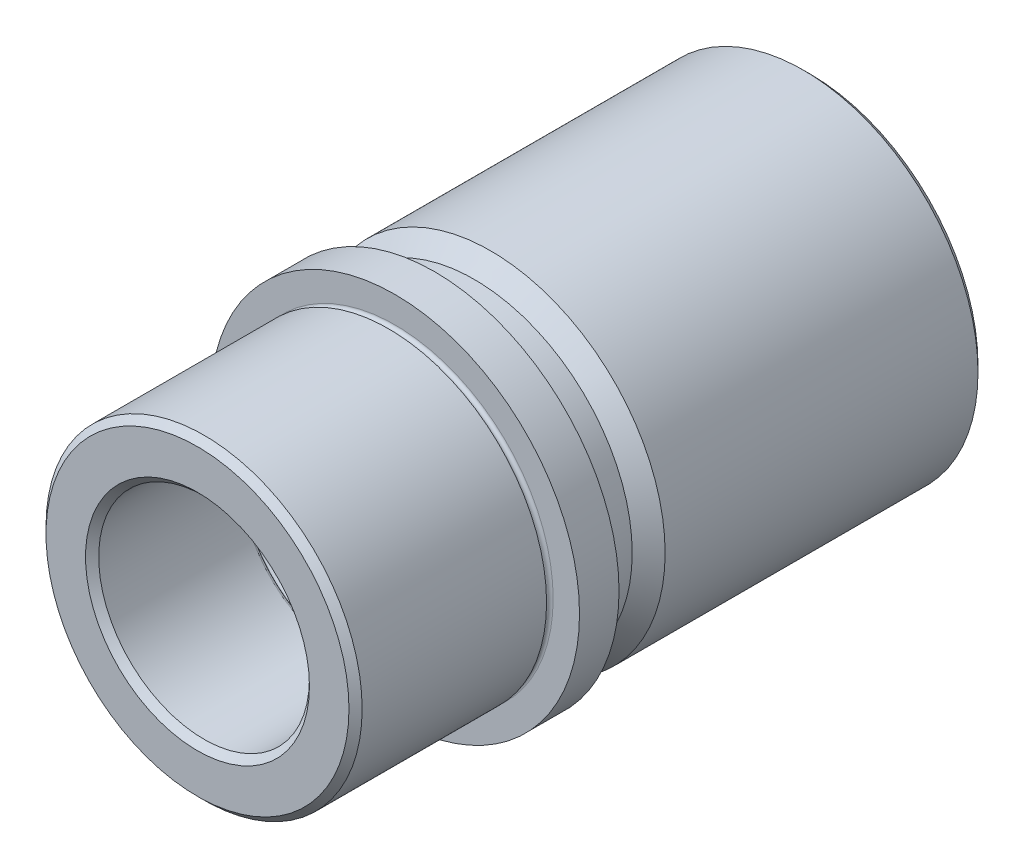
ISO-10303-21;
HEADER;
FILE_DESCRIPTION(('STEP AP214'),'2;1');
FILE_NAME('part.step','',(''),(''),'','','');
FILE_SCHEMA(('AUTOMOTIVE_DESIGN { 1 0 10303 214 1 1 1 1 }'));
ENDSEC;
DATA;
#1=APPLICATION_CONTEXT('core data for automotive mechanical design processes');
#2=APPLICATION_PROTOCOL_DEFINITION('international standard','automotive_design',2000,#1);
#3=PRODUCT_CONTEXT('',#1,'mechanical');
#4=PRODUCT('Part','Part','',(#3));
#5=PRODUCT_RELATED_PRODUCT_CATEGORY('part','',(#4));
#6=PRODUCT_DEFINITION_FORMATION('','',#4);
#7=PRODUCT_DEFINITION_CONTEXT('part definition',#1,'design');
#8=PRODUCT_DEFINITION('design','',#6,#7);
#9=PRODUCT_DEFINITION_SHAPE('','',#8);
#10=(LENGTH_UNIT() NAMED_UNIT(*) SI_UNIT(.MILLI.,.METRE.));
#11=(NAMED_UNIT(*) PLANE_ANGLE_UNIT() SI_UNIT($,.RADIAN.));
#12=(NAMED_UNIT(*) SI_UNIT($,.STERADIAN.) SOLID_ANGLE_UNIT());
#13=UNCERTAINTY_MEASURE_WITH_UNIT(LENGTH_MEASURE(1.E-05),#10,'distance_accuracy_value','');
#14=(GEOMETRIC_REPRESENTATION_CONTEXT(3) GLOBAL_UNCERTAINTY_ASSIGNED_CONTEXT((#13)) GLOBAL_UNIT_ASSIGNED_CONTEXT((#10,
#11,#12)) REPRESENTATION_CONTEXT('',''));
#15=CARTESIAN_POINT('',(0.,0.,0.));
#16=DIRECTION('',(0.,0.,1.));
#17=DIRECTION('',(1.,0.,0.));
#18=AXIS2_PLACEMENT_3D('',#15,#16,#17);
#19=CARTESIAN_POINT('',(0.,0.,-55.5));
#20=DIRECTION('',(0.,0.,1.));
#21=DIRECTION('',(1.,0.,0.));
#22=AXIS2_PLACEMENT_3D('',#19,#20,#21);
#23=TOROIDAL_SURFACE('',#22,16.5,0.5);
#24=CARTESIAN_POINT('',(0.,0.,-55.5));
#25=DIRECTION('',(0.,0.,1.));
#26=DIRECTION('',(1.,0.,0.));
#27=AXIS2_PLACEMENT_3D('',#24,#25,#26);
#28=CIRCLE('',#27,16.);
#29=CARTESIAN_POINT('',(16.,0.,-55.5));
#30=VERTEX_POINT('',#29);
#31=EDGE_CURVE('E81',#30,#30,#28,.T.);
#32=ORIENTED_EDGE('',*,*,#31,.T.);
#33=EDGE_LOOP('',(#32));
#34=FACE_BOUND('',#33,.T.);
#35=CARTESIAN_POINT('',(0.,0.,-56.));
#36=DIRECTION('',(0.,0.,1.));
#37=DIRECTION('',(1.,0.,0.));
#38=AXIS2_PLACEMENT_3D('',#35,#36,#37);
#39=CIRCLE('',#38,16.5);
#40=CARTESIAN_POINT('',(16.5,0.,-56.));
#41=VERTEX_POINT('',#40);
#42=EDGE_CURVE('E45',#41,#41,#39,.T.);
#43=ORIENTED_EDGE('',*,*,#42,.F.);
#44=EDGE_LOOP('',(#43));
#45=FACE_BOUND('',#44,.T.);
#46=ADVANCED_FACE('F13',(#34,#45),#23,.T.);
#47=CARTESIAN_POINT('',(0.,0.,-56.5));
#48=DIRECTION('',(0.,0.,1.));
#49=DIRECTION('',(1.,0.,0.));
#50=AXIS2_PLACEMENT_3D('',#47,#48,#49);
#51=TOROIDAL_SURFACE('',#50,16.5,0.5);
#52=CARTESIAN_POINT('',(0.,0.,-56.5));
#53=DIRECTION('',(0.,0.,1.));
#54=DIRECTION('',(1.,0.,0.));
#55=AXIS2_PLACEMENT_3D('',#52,#53,#54);
#56=CIRCLE('',#55,16.);
#57=CARTESIAN_POINT('',(16.,0.,-56.5));
#58=VERTEX_POINT('',#57);
#59=EDGE_CURVE('E48',#58,#58,#56,.T.);
#60=ORIENTED_EDGE('',*,*,#59,.F.);
#61=EDGE_LOOP('',(#60));
#62=FACE_BOUND('',#61,.T.);
#63=ORIENTED_EDGE('',*,*,#42,.T.);
#64=EDGE_LOOP('',(#63));
#65=FACE_BOUND('',#64,.T.);
#66=ADVANCED_FACE('F113',(#62,#65),#51,.T.);
#67=CARTESIAN_POINT('',(0.,0.,0.));
#68=DIRECTION('',(0.,0.,1.));
#69=DIRECTION('',(1.,0.,0.));
#70=AXIS2_PLACEMENT_3D('',#67,#68,#69);
#71=CYLINDRICAL_SURFACE('',#70,16.);
#72=CARTESIAN_POINT('',(0.,0.,-92.));
#73=DIRECTION('',(0.,0.,1.));
#74=DIRECTION('',(1.,0.,0.));
#75=AXIS2_PLACEMENT_3D('',#72,#73,#74);
#76=CIRCLE('',#75,16.);
#77=CARTESIAN_POINT('',(16.,0.,-92.));
#78=VERTEX_POINT('',#77);
#79=EDGE_CURVE('E36',#78,#78,#76,.F.);
#80=ORIENTED_EDGE('',*,*,#79,.T.);
#81=EDGE_LOOP('',(#80));
#82=FACE_BOUND('',#81,.T.);
#83=ORIENTED_EDGE('',*,*,#59,.T.);
#84=EDGE_LOOP('',(#83));
#85=FACE_BOUND('',#84,.T.);
#86=ADVANCED_FACE('F118',(#82,#85),#71,.F.);
#87=CARTESIAN_POINT('',(0.,0.,-93.));
#88=DIRECTION('',(0.,0.,1.));
#89=DIRECTION('',(1.,0.,0.));
#90=AXIS2_PLACEMENT_3D('',#87,#88,#89);
#91=PLANE('',#90);
#92=CARTESIAN_POINT('',(0.,0.,-93.));
#93=DIRECTION('',(0.,0.,1.));
#94=DIRECTION('',(1.,0.,0.));
#95=AXIS2_PLACEMENT_3D('',#92,#93,#94);
#96=CIRCLE('',#95,17.);
#97=CARTESIAN_POINT('',(17.,0.,-93.));
#98=VERTEX_POINT('',#97);
#99=EDGE_CURVE('E39',#98,#98,#96,.T.);
#100=ORIENTED_EDGE('',*,*,#99,.T.);
#101=EDGE_LOOP('',(#100));
#102=FACE_BOUND('',#101,.T.);
#103=CARTESIAN_POINT('',(0.,0.,-93.));
#104=DIRECTION('',(0.,0.,1.));
#105=DIRECTION('',(1.,0.,0.));
#106=AXIS2_PLACEMENT_3D('',#103,#104,#105);
#107=CIRCLE('',#106,25.5);
#108=CARTESIAN_POINT('',(25.5,0.,-93.));
#109=VERTEX_POINT('',#108);
#110=EDGE_CURVE('E42',#109,#109,#107,.F.);
#111=ORIENTED_EDGE('',*,*,#110,.T.);
#112=EDGE_LOOP('',(#111));
#113=FACE_BOUND('',#112,.T.);
#114=ADVANCED_FACE('F185',(#102,#113),#91,.F.);
#115=CARTESIAN_POINT('',(0.,0.,0.));
#116=DIRECTION('',(0.,0.,1.));
#117=DIRECTION('',(1.,0.,0.));
#118=AXIS2_PLACEMENT_3D('',#115,#116,#117);
#119=CYLINDRICAL_SURFACE('',#118,26.5);
#120=CARTESIAN_POINT('',(0.,0.,-92.));
#121=DIRECTION('',(0.,0.,1.));
#122=DIRECTION('',(1.,0.,0.));
#123=AXIS2_PLACEMENT_3D('',#120,#121,#122);
#124=CIRCLE('',#123,26.5);
#125=CARTESIAN_POINT('',(26.5,0.,-92.));
#126=VERTEX_POINT('',#125);
#127=EDGE_CURVE('E33',#126,#126,#124,.T.);
#128=ORIENTED_EDGE('',*,*,#127,.T.);
#129=EDGE_LOOP('',(#128));
#130=FACE_BOUND('',#129,.T.);
#131=CARTESIAN_POINT('',(0.,0.,-44.5));
#132=DIRECTION('',(0.,0.,1.));
#133=DIRECTION('',(1.,0.,0.));
#134=AXIS2_PLACEMENT_3D('',#131,#132,#133);
#135=CIRCLE('',#134,26.5);
#136=CARTESIAN_POINT('',(26.5,0.,-44.5));
#137=VERTEX_POINT('',#136);
#138=EDGE_CURVE('E51',#137,#137,#135,.T.);
#139=ORIENTED_EDGE('',*,*,#138,.F.);
#140=EDGE_LOOP('',(#139));
#141=FACE_BOUND('',#140,.T.);
#142=ADVANCED_FACE('F181',(#130,#141),#119,.T.);
#143=CARTESIAN_POINT('',(0.,0.,-42.));
#144=DIRECTION('',(0.,0.,-1.));
#145=DIRECTION('',(-1.,0.,0.));
#146=AXIS2_PLACEMENT_3D('',#143,#144,#145);
#147=CONICAL_SURFACE('',#146,24.,0.785398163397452);
#148=ORIENTED_EDGE('',*,*,#138,.T.);
#149=EDGE_LOOP('',(#148));
#150=FACE_BOUND('',#149,.T.);
#151=CARTESIAN_POINT('',(0.,0.,-42.));
#152=DIRECTION('',(0.,0.,1.));
#153=DIRECTION('',(1.,0.,0.));
#154=AXIS2_PLACEMENT_3D('',#151,#152,#153);
#155=CIRCLE('',#154,24.);
#156=CARTESIAN_POINT('',(24.,0.,-42.));
#157=VERTEX_POINT('',#156);
#158=EDGE_CURVE('E54',#157,#157,#155,.T.);
#159=ORIENTED_EDGE('',*,*,#158,.F.);
#160=EDGE_LOOP('',(#159));
#161=FACE_BOUND('',#160,.T.);
#162=ADVANCED_FACE('F177',(#150,#161),#147,.T.);
#163=CARTESIAN_POINT('',(0.,0.,0.));
#164=DIRECTION('',(0.,0.,1.));
#165=DIRECTION('',(1.,0.,0.));
#166=AXIS2_PLACEMENT_3D('',#163,#164,#165);
#167=CYLINDRICAL_SURFACE('',#166,24.);
#168=ORIENTED_EDGE('',*,*,#158,.T.);
#169=EDGE_LOOP('',(#168));
#170=FACE_BOUND('',#169,.T.);
#171=CARTESIAN_POINT('',(0.,0.,-36.));
#172=DIRECTION('',(0.,0.,1.));
#173=DIRECTION('',(1.,0.,0.));
#174=AXIS2_PLACEMENT_3D('',#171,#172,#173);
#175=CIRCLE('',#174,24.);
#176=CARTESIAN_POINT('',(24.,0.,-36.));
#177=VERTEX_POINT('',#176);
#178=EDGE_CURVE('E57',#177,#177,#175,.T.);
#179=ORIENTED_EDGE('',*,*,#178,.F.);
#180=EDGE_LOOP('',(#179));
#181=FACE_BOUND('',#180,.T.);
#182=ADVANCED_FACE('F173',(#170,#181),#167,.T.);
#183=CARTESIAN_POINT('',(0.,0.,-36.));
#184=DIRECTION('',(0.,0.,-1.));
#185=DIRECTION('',(-1.,0.,0.));
#186=AXIS2_PLACEMENT_3D('',#183,#184,#185);
#187=PLANE('',#186);
#188=ORIENTED_EDGE('',*,*,#178,.T.);
#189=EDGE_LOOP('',(#188));
#190=FACE_BOUND('',#189,.T.);
#191=CARTESIAN_POINT('',(0.,0.,-36.));
#192=DIRECTION('',(0.,0.,1.));
#193=DIRECTION('',(1.,0.,0.));
#194=AXIS2_PLACEMENT_3D('',#191,#192,#193);
#195=CIRCLE('',#194,28.);
#196=CARTESIAN_POINT('',(28.,0.,-36.));
#197=VERTEX_POINT('',#196);
#198=EDGE_CURVE('E60',#197,#197,#195,.T.);
#199=ORIENTED_EDGE('',*,*,#198,.F.);
#200=EDGE_LOOP('',(#199));
#201=FACE_BOUND('',#200,.T.);
#202=ADVANCED_FACE('F169',(#190,#201),#187,.T.);
#203=CARTESIAN_POINT('',(0.,0.,0.));
#204=DIRECTION('',(0.,0.,1.));
#205=DIRECTION('',(1.,0.,0.));
#206=AXIS2_PLACEMENT_3D('',#203,#204,#205);
#207=CYLINDRICAL_SURFACE('',#206,28.);
#208=ORIENTED_EDGE('',*,*,#198,.T.);
#209=EDGE_LOOP('',(#208));
#210=FACE_BOUND('',#209,.T.);
#211=CARTESIAN_POINT('',(0.,0.,-30.));
#212=DIRECTION('',(0.,0.,1.));
#213=DIRECTION('',(1.,0.,0.));
#214=AXIS2_PLACEMENT_3D('',#211,#212,#213);
#215=CIRCLE('',#214,28.);
#216=CARTESIAN_POINT('',(28.,0.,-30.));
#217=VERTEX_POINT('',#216);
#218=EDGE_CURVE('E63',#217,#217,#215,.T.);
#219=ORIENTED_EDGE('',*,*,#218,.F.);
#220=EDGE_LOOP('',(#219));
#221=FACE_BOUND('',#220,.T.);
#222=ADVANCED_FACE('F165',(#210,#221),#207,.T.);
#223=CARTESIAN_POINT('',(0.,0.,-30.));
#224=DIRECTION('',(0.,0.,1.));
#225=DIRECTION('',(1.,0.,0.));
#226=AXIS2_PLACEMENT_3D('',#223,#224,#225);
#227=PLANE('',#226);
#228=ORIENTED_EDGE('',*,*,#218,.T.);
#229=EDGE_LOOP('',(#228));
#230=FACE_BOUND('',#229,.T.);
#231=CARTESIAN_POINT('',(0.,0.,-30.));
#232=DIRECTION('',(0.,0.,1.));
#233=DIRECTION('',(1.,0.,0.));
#234=AXIS2_PLACEMENT_3D('',#231,#232,#233);
#235=CIRCLE('',#234,24.);
#236=CARTESIAN_POINT('',(24.,0.,-30.));
#237=VERTEX_POINT('',#236);
#238=EDGE_CURVE('E66',#237,#237,#235,.T.);
#239=ORIENTED_EDGE('',*,*,#238,.F.);
#240=EDGE_LOOP('',(#239));
#241=FACE_BOUND('',#240,.T.);
#242=ADVANCED_FACE('F161',(#230,#241),#227,.T.);
#243=CARTESIAN_POINT('',(0.,0.,-29.5));
#244=DIRECTION('',(0.,0.,1.));
#245=DIRECTION('',(1.,0.,0.));
#246=AXIS2_PLACEMENT_3D('',#243,#244,#245);
#247=TOROIDAL_SURFACE('',#246,24.,0.5);
#248=ORIENTED_EDGE('',*,*,#238,.T.);
#249=EDGE_LOOP('',(#248));
#250=FACE_BOUND('',#249,.T.);
#251=CARTESIAN_POINT('',(0.,0.,-29.));
#252=DIRECTION('',(0.,0.,1.));
#253=DIRECTION('',(1.,0.,0.));
#254=AXIS2_PLACEMENT_3D('',#251,#252,#253);
#255=CIRCLE('',#254,24.);
#256=CARTESIAN_POINT('',(24.,0.,-29.));
#257=VERTEX_POINT('',#256);
#258=EDGE_CURVE('E69',#257,#257,#255,.T.);
#259=ORIENTED_EDGE('',*,*,#258,.F.);
#260=EDGE_LOOP('',(#259));
#261=FACE_BOUND('',#260,.T.);
#262=ADVANCED_FACE('F156',(#250,#261),#247,.F.);
#263=CARTESIAN_POINT('',(0.,0.,0.));
#264=DIRECTION('',(0.,0.,1.));
#265=DIRECTION('',(1.,0.,0.));
#266=AXIS2_PLACEMENT_3D('',#263,#264,#265);
#267=CYLINDRICAL_SURFACE('',#266,24.);
#268=CARTESIAN_POINT('',(0.,0.,-1.00000000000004));
#269=DIRECTION('',(0.,0.,1.));
#270=DIRECTION('',(1.,0.,0.));
#271=AXIS2_PLACEMENT_3D('',#268,#269,#270);
#272=CIRCLE('',#271,24.);
#273=CARTESIAN_POINT('',(24.,0.,-1.00000000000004));
#274=VERTEX_POINT('',#273);
#275=EDGE_CURVE('E8',#274,#274,#272,.F.);
#276=ORIENTED_EDGE('',*,*,#275,.T.);
#277=EDGE_LOOP('',(#276));
#278=FACE_BOUND('',#277,.T.);
#279=ORIENTED_EDGE('',*,*,#258,.T.);
#280=EDGE_LOOP('',(#279));
#281=FACE_BOUND('',#280,.T.);
#282=ADVANCED_FACE('F149',(#278,#281),#267,.T.);
#283=CARTESIAN_POINT('',(0.,0.,0.));
#284=DIRECTION('',(0.,0.,1.));
#285=DIRECTION('',(1.,0.,0.));
#286=AXIS2_PLACEMENT_3D('',#283,#284,#285);
#287=PLANE('',#286);
#288=CARTESIAN_POINT('',(0.,0.,0.));
#289=DIRECTION('',(0.,0.,1.));
#290=DIRECTION('',(1.,0.,0.));
#291=AXIS2_PLACEMENT_3D('',#288,#289,#290);
#292=CIRCLE('',#291,17.);
#293=CARTESIAN_POINT('',(17.,0.,0.));
#294=VERTEX_POINT('',#293);
#295=EDGE_CURVE('E20',#294,#294,#292,.F.);
#296=ORIENTED_EDGE('',*,*,#295,.T.);
#297=EDGE_LOOP('',(#296));
#298=FACE_BOUND('',#297,.T.);
#299=CARTESIAN_POINT('',(0.,0.,0.));
#300=DIRECTION('',(0.,0.,1.));
#301=DIRECTION('',(1.,0.,0.));
#302=AXIS2_PLACEMENT_3D('',#299,#300,#301);
#303=CIRCLE('',#302,23.);
#304=CARTESIAN_POINT('',(23.,0.,0.));
#305=VERTEX_POINT('',#304);
#306=EDGE_CURVE('E24',#305,#305,#303,.T.);
#307=ORIENTED_EDGE('',*,*,#306,.T.);
#308=EDGE_LOOP('',(#307));
#309=FACE_BOUND('',#308,.T.);
#310=ADVANCED_FACE('F109',(#298,#309),#287,.T.);
#311=CARTESIAN_POINT('',(0.,0.,0.));
#312=DIRECTION('',(0.,0.,1.));
#313=DIRECTION('',(1.,0.,0.));
#314=AXIS2_PLACEMENT_3D('',#311,#312,#313);
#315=CYLINDRICAL_SURFACE('',#314,16.);
#316=CARTESIAN_POINT('',(0.,0.,-1.00000000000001));
#317=DIRECTION('',(0.,0.,1.));
#318=DIRECTION('',(1.,0.,0.));
#319=AXIS2_PLACEMENT_3D('',#316,#317,#318);
#320=CIRCLE('',#319,16.);
#321=CARTESIAN_POINT('',(16.,0.,-1.00000000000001));
#322=VERTEX_POINT('',#321);
#323=EDGE_CURVE('E28',#322,#322,#320,.T.);
#324=ORIENTED_EDGE('',*,*,#323,.T.);
#325=EDGE_LOOP('',(#324));
#326=FACE_BOUND('',#325,.T.);
#327=CARTESIAN_POINT('',(0.,0.,-22.5));
#328=DIRECTION('',(0.,0.,1.));
#329=DIRECTION('',(1.,0.,0.));
#330=AXIS2_PLACEMENT_3D('',#327,#328,#329);
#331=CIRCLE('',#330,16.);
#332=CARTESIAN_POINT('',(16.,0.,-22.5));
#333=VERTEX_POINT('',#332);
#334=EDGE_CURVE('E72',#333,#333,#331,.T.);
#335=ORIENTED_EDGE('',*,*,#334,.F.);
#336=EDGE_LOOP('',(#335));
#337=FACE_BOUND('',#336,.T.);
#338=ADVANCED_FACE('F102',(#326,#337),#315,.F.);
#339=CARTESIAN_POINT('',(0.,0.,-22.5));
#340=DIRECTION('',(0.,0.,1.));
#341=DIRECTION('',(1.,0.,0.));
#342=AXIS2_PLACEMENT_3D('',#339,#340,#341);
#343=TOROIDAL_SURFACE('',#342,16.5,0.5);
#344=ORIENTED_EDGE('',*,*,#334,.T.);
#345=EDGE_LOOP('',(#344));
#346=FACE_BOUND('',#345,.T.);
#347=CARTESIAN_POINT('',(0.,0.,-23.));
#348=DIRECTION('',(0.,0.,1.));
#349=DIRECTION('',(1.,0.,0.));
#350=AXIS2_PLACEMENT_3D('',#347,#348,#349);
#351=CIRCLE('',#350,16.5);
#352=CARTESIAN_POINT('',(16.5,0.,-23.));
#353=VERTEX_POINT('',#352);
#354=EDGE_CURVE('E75',#353,#353,#351,.T.);
#355=ORIENTED_EDGE('',*,*,#354,.F.);
#356=EDGE_LOOP('',(#355));
#357=FACE_BOUND('',#356,.T.);
#358=ADVANCED_FACE('F97',(#346,#357),#343,.T.);
#359=CARTESIAN_POINT('',(0.,0.,-23.5));
#360=DIRECTION('',(0.,0.,1.));
#361=DIRECTION('',(1.,0.,0.));
#362=AXIS2_PLACEMENT_3D('',#359,#360,#361);
#363=TOROIDAL_SURFACE('',#362,16.5,0.5);
#364=CARTESIAN_POINT('',(0.,0.,-23.5));
#365=DIRECTION('',(0.,0.,1.));
#366=DIRECTION('',(1.,0.,0.));
#367=AXIS2_PLACEMENT_3D('',#364,#365,#366);
#368=CIRCLE('',#367,16.);
#369=CARTESIAN_POINT('',(16.,0.,-23.5));
#370=VERTEX_POINT('',#369);
#371=EDGE_CURVE('E78',#370,#370,#368,.T.);
#372=ORIENTED_EDGE('',*,*,#371,.F.);
#373=EDGE_LOOP('',(#372));
#374=FACE_BOUND('',#373,.T.);
#375=ORIENTED_EDGE('',*,*,#354,.T.);
#376=EDGE_LOOP('',(#375));
#377=FACE_BOUND('',#376,.T.);
#378=ADVANCED_FACE('F91',(#374,#377),#363,.T.);
#379=CARTESIAN_POINT('',(0.,0.,0.));
#380=DIRECTION('',(0.,0.,1.));
#381=DIRECTION('',(1.,0.,0.));
#382=AXIS2_PLACEMENT_3D('',#379,#380,#381);
#383=CYLINDRICAL_SURFACE('',#382,16.);
#384=ORIENTED_EDGE('',*,*,#31,.F.);
#385=EDGE_LOOP('',(#384));
#386=FACE_BOUND('',#385,.T.);
#387=ORIENTED_EDGE('',*,*,#371,.T.);
#388=EDGE_LOOP('',(#387));
#389=FACE_BOUND('',#388,.T.);
#390=ADVANCED_FACE('F87',(#386,#389),#383,.F.);
#391=CARTESIAN_POINT('',(0.,0.,-93.));
#392=DIRECTION('',(0.,0.,-1.));
#393=DIRECTION('',(-1.,0.,0.));
#394=AXIS2_PLACEMENT_3D('',#391,#392,#393);
#395=CONICAL_SURFACE('',#394,17.,0.785398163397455);
#396=ORIENTED_EDGE('',*,*,#79,.F.);
#397=EDGE_LOOP('',(#396));
#398=FACE_BOUND('',#397,.T.);
#399=ORIENTED_EDGE('',*,*,#99,.F.);
#400=EDGE_LOOP('',(#399));
#401=FACE_BOUND('',#400,.T.);
#402=ADVANCED_FACE('F90',(#398,#401),#395,.F.);
#403=CARTESIAN_POINT('',(0.,0.,-92.));
#404=DIRECTION('',(0.,0.,1.));
#405=DIRECTION('',(1.,0.,0.));
#406=AXIS2_PLACEMENT_3D('',#403,#404,#405);
#407=CONICAL_SURFACE('',#406,26.5,0.785398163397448);
#408=ORIENTED_EDGE('',*,*,#110,.F.);
#409=EDGE_LOOP('',(#408));
#410=FACE_BOUND('',#409,.T.);
#411=ORIENTED_EDGE('',*,*,#127,.F.);
#412=EDGE_LOOP('',(#411));
#413=FACE_BOUND('',#412,.T.);
#414=ADVANCED_FACE('F125',(#410,#413),#407,.T.);
#415=CARTESIAN_POINT('',(0.,0.,-1.00000000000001));
#416=DIRECTION('',(0.,0.,1.));
#417=DIRECTION('',(1.,0.,0.));
#418=AXIS2_PLACEMENT_3D('',#415,#416,#417);
#419=CONICAL_SURFACE('',#418,16.,0.785398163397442);
#420=ORIENTED_EDGE('',*,*,#295,.F.);
#421=EDGE_LOOP('',(#420));
#422=FACE_BOUND('',#421,.T.);
#423=ORIENTED_EDGE('',*,*,#323,.F.);
#424=EDGE_LOOP('',(#423));
#425=FACE_BOUND('',#424,.T.);
#426=ADVANCED_FACE('F128',(#422,#425),#419,.F.);
#427=CARTESIAN_POINT('',(0.,0.,0.));
#428=DIRECTION('',(0.,0.,-1.));
#429=DIRECTION('',(-1.,0.,0.));
#430=AXIS2_PLACEMENT_3D('',#427,#428,#429);
#431=CONICAL_SURFACE('',#430,23.,0.785398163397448);
#432=ORIENTED_EDGE('',*,*,#275,.F.);
#433=EDGE_LOOP('',(#432));
#434=FACE_BOUND('',#433,.T.);
#435=ORIENTED_EDGE('',*,*,#306,.F.);
#436=EDGE_LOOP('',(#435));
#437=FACE_BOUND('',#436,.T.);
#438=ADVANCED_FACE('F15',(#434,#437),#431,.T.);
#439=CLOSED_SHELL('',(#46,#66,#86,#114,#142,#162,#182,#202,#222,#242,#262,#282,#310,#338,#358,
#378,#390,#402,#414,#426,#438));
#440=MANIFOLD_SOLID_BREP('B1',#439);
#441=ADVANCED_BREP_SHAPE_REPRESENTATION('',(#18,#440),#14);
#442=SHAPE_DEFINITION_REPRESENTATION(#9,#441);
ENDSEC;
END-ISO-10303-21;
